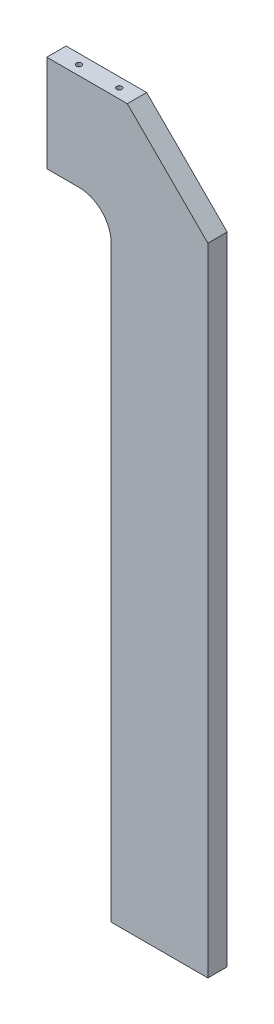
ISO-10303-21;
HEADER;
FILE_DESCRIPTION(('STEP AP214'),'2;1');
FILE_NAME('part.step','',(''),(''),'','','');
FILE_SCHEMA(('AUTOMOTIVE_DESIGN { 1 0 10303 214 1 1 1 1 }'));
ENDSEC;
DATA;
#1=APPLICATION_CONTEXT('core data for automotive mechanical design processes');
#2=APPLICATION_PROTOCOL_DEFINITION('international standard','automotive_design',2000,#1);
#3=PRODUCT_CONTEXT('',#1,'mechanical');
#4=PRODUCT('Part','Part','',(#3));
#5=PRODUCT_RELATED_PRODUCT_CATEGORY('part','',(#4));
#6=PRODUCT_DEFINITION_FORMATION('','',#4);
#7=PRODUCT_DEFINITION_CONTEXT('part definition',#1,'design');
#8=PRODUCT_DEFINITION('design','',#6,#7);
#9=PRODUCT_DEFINITION_SHAPE('','',#8);
#10=(LENGTH_UNIT() NAMED_UNIT(*) SI_UNIT(.MILLI.,.METRE.));
#11=(NAMED_UNIT(*) PLANE_ANGLE_UNIT() SI_UNIT($,.RADIAN.));
#12=(NAMED_UNIT(*) SI_UNIT($,.STERADIAN.) SOLID_ANGLE_UNIT());
#13=UNCERTAINTY_MEASURE_WITH_UNIT(LENGTH_MEASURE(1.E-05),#10,'distance_accuracy_value','');
#14=(GEOMETRIC_REPRESENTATION_CONTEXT(3) GLOBAL_UNCERTAINTY_ASSIGNED_CONTEXT((#13)) GLOBAL_UNIT_ASSIGNED_CONTEXT((#10,
#11,#12)) REPRESENTATION_CONTEXT('',''));
#15=CARTESIAN_POINT('',(0.,0.,0.));
#16=DIRECTION('',(0.,0.,1.));
#17=DIRECTION('',(1.,0.,0.));
#18=AXIS2_PLACEMENT_3D('',#15,#16,#17);
#19=CARTESIAN_POINT('',(-9.80148028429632,-337.147129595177,12.));
#20=DIRECTION('',(-1.,0.,0.));
#21=DIRECTION('',(0.,0.,1.));
#22=AXIS2_PLACEMENT_3D('',#19,#20,#21);
#23=PLANE('',#22);
#24=DIRECTION('',(0.,1.,0.));
#25=VECTOR('',#24,1.);
#26=CARTESIAN_POINT('',(-9.80148028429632,-337.147129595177,0.));
#27=LINE('',#26,#25);
#28=CARTESIAN_POINT('',(-9.80148028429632,-337.147129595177,0.));
#29=VERTEX_POINT('',#28);
#30=CARTESIAN_POINT('',(-9.80148028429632,57.8528704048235,0.));
#31=VERTEX_POINT('',#30);
#32=EDGE_CURVE('E250',#29,#31,#27,.T.);
#33=ORIENTED_EDGE('',*,*,#32,.T.);
#34=DIRECTION('',(0.,0.,1.));
#35=VECTOR('',#34,1.);
#36=CARTESIAN_POINT('',(-9.80148028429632,57.8528704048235,12.));
#37=LINE('',#36,#35);
#38=CARTESIAN_POINT('',(-9.80148028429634,57.8528704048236,12.));
#39=VERTEX_POINT('',#38);
#40=EDGE_CURVE('E253',#31,#39,#37,.T.);
#41=ORIENTED_EDGE('',*,*,#40,.T.);
#42=DIRECTION('',(0.,1.,0.));
#43=VECTOR('',#42,1.);
#44=CARTESIAN_POINT('',(-9.80148028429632,-337.147129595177,12.));
#45=LINE('',#44,#43);
#46=CARTESIAN_POINT('',(-9.80148028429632,-337.147129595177,12.));
#47=VERTEX_POINT('',#46);
#48=EDGE_CURVE('E289',#47,#39,#45,.T.);
#49=ORIENTED_EDGE('',*,*,#48,.F.);
#50=DIRECTION('',(0.,0.,-1.));
#51=VECTOR('',#50,1.);
#52=CARTESIAN_POINT('',(-9.80148028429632,-337.147129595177,12.));
#53=LINE('',#52,#51);
#54=EDGE_CURVE('E256',#47,#29,#53,.T.);
#55=ORIENTED_EDGE('',*,*,#54,.T.);
#56=EDGE_LOOP('',(#33,#41,#49,#55));
#57=FACE_BOUND('',#56,.T.);
#58=ADVANCED_FACE('F16',(#57),#23,.F.);
#59=CARTESIAN_POINT('',(-9.80148028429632,107.852870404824,12.));
#60=DIRECTION('',(0.,-1.,0.));
#61=DIRECTION('',(0.,0.,-1.));
#62=AXIS2_PLACEMENT_3D('',#59,#60,#61);
#63=PLANE('',#62);
#64=CARTESIAN_POINT('',(-95.8014802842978,107.852870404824,5.99999999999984));
#65=DIRECTION('',(0.,1.,0.));
#66=DIRECTION('',(0.,0.,1.));
#67=AXIS2_PLACEMENT_3D('',#64,#65,#66);
#68=CIRCLE('',#67,1.65);
#69=CARTESIAN_POINT('',(-95.8014802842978,107.852870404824,7.64999999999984));
#70=VERTEX_POINT('',#69);
#71=EDGE_CURVE('E130',#70,#70,#68,.T.);
#72=ORIENTED_EDGE('',*,*,#71,.F.);
#73=EDGE_LOOP('',(#72));
#74=FACE_BOUND('',#73,.T.);
#75=CARTESIAN_POINT('',(-70.8014802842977,107.852870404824,5.99999999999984));
#76=DIRECTION('',(0.,1.,0.));
#77=DIRECTION('',(0.,0.,1.));
#78=AXIS2_PLACEMENT_3D('',#75,#76,#77);
#79=CIRCLE('',#78,1.65);
#80=CARTESIAN_POINT('',(-70.8014802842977,107.852870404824,7.64999999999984));
#81=VERTEX_POINT('',#80);
#82=EDGE_CURVE('E349',#81,#81,#79,.T.);
#83=ORIENTED_EDGE('',*,*,#82,.F.);
#84=EDGE_LOOP('',(#83));
#85=FACE_BOUND('',#84,.T.);
#86=DIRECTION('',(-1.,0.,0.));
#87=VECTOR('',#86,1.);
#88=CARTESIAN_POINT('',(-9.80148028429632,107.852870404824,12.));
#89=LINE('',#88,#87);
#90=CARTESIAN_POINT('',(-59.8014802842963,107.852870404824,12.));
#91=VERTEX_POINT('',#90);
#92=CARTESIAN_POINT('',(-109.801480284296,107.852870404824,12.));
#93=VERTEX_POINT('',#92);
#94=EDGE_CURVE('E308',#91,#93,#89,.T.);
#95=ORIENTED_EDGE('',*,*,#94,.F.);
#96=DIRECTION('',(0.,0.,-1.));
#97=VECTOR('',#96,1.);
#98=CARTESIAN_POINT('',(-59.8014802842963,107.852870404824,12.));
#99=LINE('',#98,#97);
#100=CARTESIAN_POINT('',(-59.8014802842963,107.852870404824,0.));
#101=VERTEX_POINT('',#100);
#102=EDGE_CURVE('E266',#91,#101,#99,.T.);
#103=ORIENTED_EDGE('',*,*,#102,.T.);
#104=DIRECTION('',(-1.,0.,0.));
#105=VECTOR('',#104,1.);
#106=CARTESIAN_POINT('',(-9.80148028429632,107.852870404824,0.));
#107=LINE('',#106,#105);
#108=CARTESIAN_POINT('',(-109.801480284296,107.852870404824,0.));
#109=VERTEX_POINT('',#108);
#110=EDGE_CURVE('E258',#101,#109,#107,.T.);
#111=ORIENTED_EDGE('',*,*,#110,.T.);
#112=DIRECTION('',(0.,0.,-1.));
#113=VECTOR('',#112,1.);
#114=CARTESIAN_POINT('',(-109.801480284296,107.852870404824,12.));
#115=LINE('',#114,#113);
#116=EDGE_CURVE('E270',#93,#109,#115,.T.);
#117=ORIENTED_EDGE('',*,*,#116,.F.);
#118=EDGE_LOOP('',(#95,#103,#111,#117));
#119=FACE_BOUND('',#118,.T.);
#120=ADVANCED_FACE('F237',(#74,#85,#119),#63,.F.);
#121=CARTESIAN_POINT('',(-109.801480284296,107.852870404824,12.));
#122=DIRECTION('',(1.,0.,0.));
#123=DIRECTION('',(0.,1.,0.));
#124=AXIS2_PLACEMENT_3D('',#121,#122,#123);
#125=PLANE('',#124);
#126=CARTESIAN_POINT('',(-109.801480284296,102.852870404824,6.));
#127=DIRECTION('',(-1.,0.,0.));
#128=DIRECTION('',(0.,0.,1.));
#129=AXIS2_PLACEMENT_3D('',#126,#127,#128);
#130=CIRCLE('',#129,2.5);
#131=CARTESIAN_POINT('',(-109.801480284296,102.852870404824,8.5));
#132=VERTEX_POINT('',#131);
#133=EDGE_CURVE('E344',#132,#132,#130,.T.);
#134=ORIENTED_EDGE('',*,*,#133,.F.);
#135=EDGE_LOOP('',(#134));
#136=FACE_BOUND('',#135,.T.);
#137=CARTESIAN_POINT('',(-109.801480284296,77.8528704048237,6.));
#138=DIRECTION('',(-1.,0.,0.));
#139=DIRECTION('',(0.,0.,1.));
#140=AXIS2_PLACEMENT_3D('',#137,#138,#139);
#141=CIRCLE('',#140,2.5);
#142=CARTESIAN_POINT('',(-109.801480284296,77.8528704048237,8.5));
#143=VERTEX_POINT('',#142);
#144=EDGE_CURVE('E337',#143,#143,#141,.T.);
#145=ORIENTED_EDGE('',*,*,#144,.F.);
#146=EDGE_LOOP('',(#145));
#147=FACE_BOUND('',#146,.T.);
#148=CARTESIAN_POINT('',(-109.801480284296,52.8528704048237,6.));
#149=DIRECTION('',(-1.,0.,0.));
#150=DIRECTION('',(0.,0.,1.));
#151=AXIS2_PLACEMENT_3D('',#148,#149,#150);
#152=CIRCLE('',#151,2.5);
#153=CARTESIAN_POINT('',(-109.801480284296,52.8528704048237,8.5));
#154=VERTEX_POINT('',#153);
#155=EDGE_CURVE('E331',#154,#154,#152,.T.);
#156=ORIENTED_EDGE('',*,*,#155,.F.);
#157=EDGE_LOOP('',(#156));
#158=FACE_BOUND('',#157,.T.);
#159=DIRECTION('',(0.,-1.,0.));
#160=VECTOR('',#159,1.);
#161=CARTESIAN_POINT('',(-109.801480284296,107.852870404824,0.));
#162=LINE('',#161,#160);
#163=CARTESIAN_POINT('',(-109.801480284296,47.8528704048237,0.));
#164=VERTEX_POINT('',#163);
#165=EDGE_CURVE('E296',#109,#164,#162,.T.);
#166=ORIENTED_EDGE('',*,*,#165,.T.);
#167=DIRECTION('',(0.,0.,-1.));
#168=VECTOR('',#167,1.);
#169=CARTESIAN_POINT('',(-109.801480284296,47.8528704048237,12.));
#170=LINE('',#169,#168);
#171=CARTESIAN_POINT('',(-109.801480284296,47.8528704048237,12.));
#172=VERTEX_POINT('',#171);
#173=EDGE_CURVE('E273',#172,#164,#170,.T.);
#174=ORIENTED_EDGE('',*,*,#173,.F.);
#175=DIRECTION('',(0.,-1.,0.));
#176=VECTOR('',#175,1.);
#177=CARTESIAN_POINT('',(-109.801480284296,107.852870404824,12.));
#178=LINE('',#177,#176);
#179=EDGE_CURVE('E306',#93,#172,#178,.T.);
#180=ORIENTED_EDGE('',*,*,#179,.F.);
#181=ORIENTED_EDGE('',*,*,#116,.T.);
#182=EDGE_LOOP('',(#166,#174,#180,#181));
#183=FACE_BOUND('',#182,.T.);
#184=ADVANCED_FACE('F233',(#136,#147,#158,#183),#125,.F.);
#185=CARTESIAN_POINT('',(-89.8014802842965,47.8528704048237,12.));
#186=DIRECTION('',(0.,1.,0.));
#187=DIRECTION('',(-1.,0.,0.));
#188=AXIS2_PLACEMENT_3D('',#185,#186,#187);
#189=PLANE('',#188);
#190=DIRECTION('',(1.,0.,0.));
#191=VECTOR('',#190,1.);
#192=CARTESIAN_POINT('',(-89.8014802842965,47.8528704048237,0.));
#193=LINE('',#192,#191);
#194=CARTESIAN_POINT('',(-89.8014802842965,47.8528704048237,0.));
#195=VERTEX_POINT('',#194);
#196=EDGE_CURVE('E294',#164,#195,#193,.T.);
#197=ORIENTED_EDGE('',*,*,#196,.T.);
#198=DIRECTION('',(0.,0.,-1.));
#199=VECTOR('',#198,1.);
#200=CARTESIAN_POINT('',(-89.8014802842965,47.8528704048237,12.));
#201=LINE('',#200,#199);
#202=CARTESIAN_POINT('',(-89.8014802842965,47.8528704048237,12.));
#203=VERTEX_POINT('',#202);
#204=EDGE_CURVE('E276',#203,#195,#201,.T.);
#205=ORIENTED_EDGE('',*,*,#204,.F.);
#206=DIRECTION('',(1.,0.,0.));
#207=VECTOR('',#206,1.);
#208=CARTESIAN_POINT('',(-89.8014802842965,47.8528704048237,12.));
#209=LINE('',#208,#207);
#210=EDGE_CURVE('E304',#172,#203,#209,.T.);
#211=ORIENTED_EDGE('',*,*,#210,.F.);
#212=ORIENTED_EDGE('',*,*,#173,.T.);
#213=EDGE_LOOP('',(#197,#205,#211,#212));
#214=FACE_BOUND('',#213,.T.);
#215=ADVANCED_FACE('F229',(#214),#189,.F.);
#216=CARTESIAN_POINT('',(-89.8014802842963,27.8528704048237,12.));
#217=DIRECTION('',(0.,0.,-1.));
#218=DIRECTION('',(-1.,0.,0.));
#219=AXIS2_PLACEMENT_3D('',#216,#217,#218);
#220=CYLINDRICAL_SURFACE('',#219,20.);
#221=CARTESIAN_POINT('',(-89.8014802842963,27.8528704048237,0.));
#222=DIRECTION('',(0.,0.,-1.));
#223=DIRECTION('',(1.,0.,0.));
#224=AXIS2_PLACEMENT_3D('',#221,#222,#223);
#225=CIRCLE('',#224,20.);
#226=CARTESIAN_POINT('',(-69.8014802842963,27.8528704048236,0.));
#227=VERTEX_POINT('',#226);
#228=EDGE_CURVE('E292',#195,#227,#225,.T.);
#229=ORIENTED_EDGE('',*,*,#228,.T.);
#230=DIRECTION('',(0.,0.,-1.));
#231=VECTOR('',#230,1.);
#232=CARTESIAN_POINT('',(-69.8014802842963,27.8528704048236,12.));
#233=LINE('',#232,#231);
#234=CARTESIAN_POINT('',(-69.8014802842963,27.8528704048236,12.));
#235=VERTEX_POINT('',#234);
#236=EDGE_CURVE('E279',#235,#227,#233,.T.);
#237=ORIENTED_EDGE('',*,*,#236,.F.);
#238=CARTESIAN_POINT('',(-89.8014802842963,27.8528704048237,12.));
#239=DIRECTION('',(0.,0.,-1.));
#240=DIRECTION('',(1.,0.,0.));
#241=AXIS2_PLACEMENT_3D('',#238,#239,#240);
#242=CIRCLE('',#241,20.);
#243=EDGE_CURVE('E302',#203,#235,#242,.T.);
#244=ORIENTED_EDGE('',*,*,#243,.F.);
#245=ORIENTED_EDGE('',*,*,#204,.T.);
#246=EDGE_LOOP('',(#229,#237,#244,#245));
#247=FACE_BOUND('',#246,.T.);
#248=ADVANCED_FACE('F225',(#247),#220,.F.);
#249=CARTESIAN_POINT('',(-69.8014802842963,-337.147129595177,12.));
#250=DIRECTION('',(1.,0.,0.));
#251=DIRECTION('',(0.,0.,-1.));
#252=AXIS2_PLACEMENT_3D('',#249,#250,#251);
#253=PLANE('',#252);
#254=DIRECTION('',(0.,-1.,0.));
#255=VECTOR('',#254,1.);
#256=CARTESIAN_POINT('',(-69.8014802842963,-337.147129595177,0.));
#257=LINE('',#256,#255);
#258=CARTESIAN_POINT('',(-69.8014802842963,-337.147129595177,0.));
#259=VERTEX_POINT('',#258);
#260=EDGE_CURVE('E290',#227,#259,#257,.T.);
#261=ORIENTED_EDGE('',*,*,#260,.T.);
#262=DIRECTION('',(0.,0.,-1.));
#263=VECTOR('',#262,1.);
#264=CARTESIAN_POINT('',(-69.8014802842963,-337.147129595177,12.));
#265=LINE('',#264,#263);
#266=CARTESIAN_POINT('',(-69.8014802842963,-337.147129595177,12.));
#267=VERTEX_POINT('',#266);
#268=EDGE_CURVE('E282',#267,#259,#265,.T.);
#269=ORIENTED_EDGE('',*,*,#268,.F.);
#270=DIRECTION('',(0.,-1.,0.));
#271=VECTOR('',#270,1.);
#272=CARTESIAN_POINT('',(-69.8014802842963,-337.147129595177,12.));
#273=LINE('',#272,#271);
#274=EDGE_CURVE('E300',#235,#267,#273,.T.);
#275=ORIENTED_EDGE('',*,*,#274,.F.);
#276=ORIENTED_EDGE('',*,*,#236,.T.);
#277=EDGE_LOOP('',(#261,#269,#275,#276));
#278=FACE_BOUND('',#277,.T.);
#279=ADVANCED_FACE('F221',(#278),#253,.F.);
#280=CARTESIAN_POINT('',(-9.80148028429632,-337.147129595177,12.));
#281=DIRECTION('',(0.,1.,0.));
#282=DIRECTION('',(0.,0.,1.));
#283=AXIS2_PLACEMENT_3D('',#280,#281,#282);
#284=PLANE('',#283);
#285=CARTESIAN_POINT('',(-57.8014802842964,-337.147129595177,6.));
#286=DIRECTION('',(0.,-1.,0.));
#287=DIRECTION('',(0.,0.,-1.));
#288=AXIS2_PLACEMENT_3D('',#285,#286,#287);
#289=CIRCLE('',#288,2.5);
#290=CARTESIAN_POINT('',(-57.8014802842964,-337.147129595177,3.5));
#291=VERTEX_POINT('',#290);
#292=EDGE_CURVE('E325',#291,#291,#289,.T.);
#293=ORIENTED_EDGE('',*,*,#292,.F.);
#294=EDGE_LOOP('',(#293));
#295=FACE_BOUND('',#294,.T.);
#296=CARTESIAN_POINT('',(-39.8014802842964,-337.147129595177,6.));
#297=DIRECTION('',(0.,-1.,0.));
#298=DIRECTION('',(0.,0.,-1.));
#299=AXIS2_PLACEMENT_3D('',#296,#297,#298);
#300=CIRCLE('',#299,2.5);
#301=CARTESIAN_POINT('',(-39.8014802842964,-337.147129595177,3.5));
#302=VERTEX_POINT('',#301);
#303=EDGE_CURVE('E319',#302,#302,#300,.T.);
#304=ORIENTED_EDGE('',*,*,#303,.F.);
#305=EDGE_LOOP('',(#304));
#306=FACE_BOUND('',#305,.T.);
#307=CARTESIAN_POINT('',(-21.8014802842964,-337.147129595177,6.));
#308=DIRECTION('',(0.,-1.,0.));
#309=DIRECTION('',(0.,0.,-1.));
#310=AXIS2_PLACEMENT_3D('',#307,#308,#309);
#311=CIRCLE('',#310,2.5);
#312=CARTESIAN_POINT('',(-21.8014802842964,-337.147129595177,3.5));
#313=VERTEX_POINT('',#312);
#314=EDGE_CURVE('E313',#313,#313,#311,.T.);
#315=ORIENTED_EDGE('',*,*,#314,.F.);
#316=EDGE_LOOP('',(#315));
#317=FACE_BOUND('',#316,.T.);
#318=DIRECTION('',(1.,0.,0.));
#319=VECTOR('',#318,1.);
#320=CARTESIAN_POINT('',(-9.80148028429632,-337.147129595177,0.));
#321=LINE('',#320,#319);
#322=EDGE_CURVE('E287',#259,#29,#321,.T.);
#323=ORIENTED_EDGE('',*,*,#322,.T.);
#324=ORIENTED_EDGE('',*,*,#54,.F.);
#325=DIRECTION('',(1.,0.,0.));
#326=VECTOR('',#325,1.);
#327=CARTESIAN_POINT('',(-9.80148028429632,-337.147129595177,12.));
#328=LINE('',#327,#326);
#329=EDGE_CURVE('E286',#267,#47,#328,.T.);
#330=ORIENTED_EDGE('',*,*,#329,.F.);
#331=ORIENTED_EDGE('',*,*,#268,.T.);
#332=EDGE_LOOP('',(#323,#324,#330,#331));
#333=FACE_BOUND('',#332,.T.);
#334=ADVANCED_FACE('F214',(#295,#306,#317,#333),#284,.F.);
#335=CARTESIAN_POINT('',(-89.8014802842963,27.8528704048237,12.));
#336=DIRECTION('',(0.,0.,1.));
#337=DIRECTION('',(1.,0.,0.));
#338=AXIS2_PLACEMENT_3D('',#335,#336,#337);
#339=PLANE('',#338);
#340=ORIENTED_EDGE('',*,*,#48,.T.);
#341=DIRECTION('',(0.707106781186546,-0.707106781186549,0.));
#342=VECTOR('',#341,1.);
#343=CARTESIAN_POINT('',(-34.8014802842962,82.8528704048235,12.));
#344=LINE('',#343,#342);
#345=EDGE_CURVE('E162',#39,#91,#344,.F.);
#346=ORIENTED_EDGE('',*,*,#345,.T.);
#347=ORIENTED_EDGE('',*,*,#94,.T.);
#348=ORIENTED_EDGE('',*,*,#179,.T.);
#349=ORIENTED_EDGE('',*,*,#210,.T.);
#350=ORIENTED_EDGE('',*,*,#243,.T.);
#351=ORIENTED_EDGE('',*,*,#274,.T.);
#352=ORIENTED_EDGE('',*,*,#329,.T.);
#353=EDGE_LOOP('',(#340,#346,#347,#348,#349,#350,#351,#352));
#354=FACE_BOUND('',#353,.T.);
#355=ADVANCED_FACE('F210',(#354),#339,.T.);
#356=CARTESIAN_POINT('',(-89.8014802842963,27.8528704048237,0.));
#357=DIRECTION('',(0.,0.,1.));
#358=DIRECTION('',(1.,0.,0.));
#359=AXIS2_PLACEMENT_3D('',#356,#357,#358);
#360=PLANE('',#359);
#361=ORIENTED_EDGE('',*,*,#110,.F.);
#362=DIRECTION('',(-0.707106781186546,0.707106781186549,0.));
#363=VECTOR('',#362,1.);
#364=CARTESIAN_POINT('',(-59.8014802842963,107.852870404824,0.));
#365=LINE('',#364,#363);
#366=EDGE_CURVE('E264',#101,#31,#365,.F.);
#367=ORIENTED_EDGE('',*,*,#366,.T.);
#368=ORIENTED_EDGE('',*,*,#32,.F.);
#369=ORIENTED_EDGE('',*,*,#322,.F.);
#370=ORIENTED_EDGE('',*,*,#260,.F.);
#371=ORIENTED_EDGE('',*,*,#228,.F.);
#372=ORIENTED_EDGE('',*,*,#196,.F.);
#373=ORIENTED_EDGE('',*,*,#165,.F.);
#374=EDGE_LOOP('',(#361,#367,#368,#369,#370,#371,#372,#373));
#375=FACE_BOUND('',#374,.T.);
#376=ADVANCED_FACE('F213',(#375),#360,.F.);
#377=CARTESIAN_POINT('',(-59.8014802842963,107.852870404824,12.));
#378=DIRECTION('',(-0.707106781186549,-0.707106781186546,0.));
#379=DIRECTION('',(0.,0.,-1.));
#380=AXIS2_PLACEMENT_3D('',#377,#378,#379);
#381=PLANE('',#380);
#382=ORIENTED_EDGE('',*,*,#345,.F.);
#383=ORIENTED_EDGE('',*,*,#40,.F.);
#384=ORIENTED_EDGE('',*,*,#366,.F.);
#385=ORIENTED_EDGE('',*,*,#102,.F.);
#386=EDGE_LOOP('',(#382,#383,#384,#385));
#387=FACE_BOUND('',#386,.T.);
#388=ADVANCED_FACE('F18',(#387),#381,.F.);
#389=CARTESIAN_POINT('',(-21.8014802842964,-322.147129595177,6.));
#390=DIRECTION('',(0.,-1.,0.));
#391=DIRECTION('',(0.,0.,-1.));
#392=AXIS2_PLACEMENT_3D('',#389,#390,#391);
#393=CONICAL_SURFACE('',#392,2.5,1.02974425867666);
#394=CARTESIAN_POINT('',(-21.8014802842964,-320.644978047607,6.));
#395=VERTEX_POINT('',#394);
#396=VERTEX_LOOP('',#395);
#397=FACE_BOUND('',#396,.T.);
#398=CARTESIAN_POINT('',(-21.8014802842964,-322.147129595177,6.));
#399=DIRECTION('',(0.,-1.,0.));
#400=DIRECTION('',(0.,0.,-1.));
#401=AXIS2_PLACEMENT_3D('',#398,#399,#400);
#402=CIRCLE('',#401,2.5);
#403=CARTESIAN_POINT('',(-21.8014802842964,-322.147129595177,3.5));
#404=VERTEX_POINT('',#403);
#405=EDGE_CURVE('E259',#404,#404,#402,.T.);
#406=ORIENTED_EDGE('',*,*,#405,.T.);
#407=EDGE_LOOP('',(#406));
#408=FACE_BOUND('',#407,.T.);
#409=ADVANCED_FACE('F205',(#397,#408),#393,.F.);
#410=CARTESIAN_POINT('',(-21.8014802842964,-337.147129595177,6.));
#411=DIRECTION('',(0.,-1.,0.));
#412=DIRECTION('',(0.,0.,-1.));
#413=AXIS2_PLACEMENT_3D('',#410,#411,#412);
#414=CYLINDRICAL_SURFACE('',#413,2.5);
#415=ORIENTED_EDGE('',*,*,#405,.F.);
#416=EDGE_LOOP('',(#415));
#417=FACE_BOUND('',#416,.T.);
#418=ORIENTED_EDGE('',*,*,#314,.T.);
#419=EDGE_LOOP('',(#418));
#420=FACE_BOUND('',#419,.T.);
#421=ADVANCED_FACE('F201',(#417,#420),#414,.F.);
#422=CARTESIAN_POINT('',(-39.8014802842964,-322.147129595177,6.));
#423=DIRECTION('',(0.,-1.,0.));
#424=DIRECTION('',(0.,0.,-1.));
#425=AXIS2_PLACEMENT_3D('',#422,#423,#424);
#426=CONICAL_SURFACE('',#425,2.5,1.02974425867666);
#427=CARTESIAN_POINT('',(-39.8014802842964,-320.644978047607,6.));
#428=VERTEX_POINT('',#427);
#429=VERTEX_LOOP('',#428);
#430=FACE_BOUND('',#429,.T.);
#431=CARTESIAN_POINT('',(-39.8014802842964,-322.147129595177,6.));
#432=DIRECTION('',(0.,-1.,0.));
#433=DIRECTION('',(0.,0.,-1.));
#434=AXIS2_PLACEMENT_3D('',#431,#432,#433);
#435=CIRCLE('',#434,2.5);
#436=CARTESIAN_POINT('',(-39.8014802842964,-322.147129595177,3.5));
#437=VERTEX_POINT('',#436);
#438=EDGE_CURVE('E316',#437,#437,#435,.T.);
#439=ORIENTED_EDGE('',*,*,#438,.T.);
#440=EDGE_LOOP('',(#439));
#441=FACE_BOUND('',#440,.T.);
#442=ADVANCED_FACE('F197',(#430,#441),#426,.F.);
#443=CARTESIAN_POINT('',(-39.8014802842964,-337.147129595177,6.));
#444=DIRECTION('',(0.,-1.,0.));
#445=DIRECTION('',(0.,0.,-1.));
#446=AXIS2_PLACEMENT_3D('',#443,#444,#445);
#447=CYLINDRICAL_SURFACE('',#446,2.5);
#448=ORIENTED_EDGE('',*,*,#438,.F.);
#449=EDGE_LOOP('',(#448));
#450=FACE_BOUND('',#449,.T.);
#451=ORIENTED_EDGE('',*,*,#303,.T.);
#452=EDGE_LOOP('',(#451));
#453=FACE_BOUND('',#452,.T.);
#454=ADVANCED_FACE('F193',(#450,#453),#447,.F.);
#455=CARTESIAN_POINT('',(-57.8014802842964,-322.147129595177,6.));
#456=DIRECTION('',(0.,-1.,0.));
#457=DIRECTION('',(0.,0.,-1.));
#458=AXIS2_PLACEMENT_3D('',#455,#456,#457);
#459=CONICAL_SURFACE('',#458,2.5,1.02974425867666);
#460=CARTESIAN_POINT('',(-57.8014802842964,-320.644978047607,6.));
#461=VERTEX_POINT('',#460);
#462=VERTEX_LOOP('',#461);
#463=FACE_BOUND('',#462,.T.);
#464=CARTESIAN_POINT('',(-57.8014802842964,-322.147129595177,6.));
#465=DIRECTION('',(0.,-1.,0.));
#466=DIRECTION('',(0.,0.,-1.));
#467=AXIS2_PLACEMENT_3D('',#464,#465,#466);
#468=CIRCLE('',#467,2.5);
#469=CARTESIAN_POINT('',(-57.8014802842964,-322.147129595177,3.5));
#470=VERTEX_POINT('',#469);
#471=EDGE_CURVE('E322',#470,#470,#468,.T.);
#472=ORIENTED_EDGE('',*,*,#471,.T.);
#473=EDGE_LOOP('',(#472));
#474=FACE_BOUND('',#473,.T.);
#475=ADVANCED_FACE('F189',(#463,#474),#459,.F.);
#476=CARTESIAN_POINT('',(-57.8014802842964,-337.147129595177,6.));
#477=DIRECTION('',(0.,-1.,0.));
#478=DIRECTION('',(0.,0.,-1.));
#479=AXIS2_PLACEMENT_3D('',#476,#477,#478);
#480=CYLINDRICAL_SURFACE('',#479,2.5);
#481=ORIENTED_EDGE('',*,*,#471,.F.);
#482=EDGE_LOOP('',(#481));
#483=FACE_BOUND('',#482,.T.);
#484=ORIENTED_EDGE('',*,*,#292,.T.);
#485=EDGE_LOOP('',(#484));
#486=FACE_BOUND('',#485,.T.);
#487=ADVANCED_FACE('F185',(#483,#486),#480,.F.);
#488=CARTESIAN_POINT('',(-94.8014802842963,52.8528704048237,6.));
#489=DIRECTION('',(-1.,0.,0.));
#490=DIRECTION('',(0.,0.,1.));
#491=AXIS2_PLACEMENT_3D('',#488,#489,#490);
#492=CONICAL_SURFACE('',#491,2.5,1.02974425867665);
#493=CARTESIAN_POINT('',(-93.2993287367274,52.8528704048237,6.));
#494=VERTEX_POINT('',#493);
#495=VERTEX_LOOP('',#494);
#496=FACE_BOUND('',#495,.T.);
#497=CARTESIAN_POINT('',(-94.8014802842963,52.8528704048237,6.));
#498=DIRECTION('',(-1.,0.,0.));
#499=DIRECTION('',(0.,0.,1.));
#500=AXIS2_PLACEMENT_3D('',#497,#498,#499);
#501=CIRCLE('',#500,2.5);
#502=CARTESIAN_POINT('',(-94.8014802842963,52.8528704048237,8.5));
#503=VERTEX_POINT('',#502);
#504=EDGE_CURVE('E328',#503,#503,#501,.T.);
#505=ORIENTED_EDGE('',*,*,#504,.T.);
#506=EDGE_LOOP('',(#505));
#507=FACE_BOUND('',#506,.T.);
#508=ADVANCED_FACE('F181',(#496,#507),#492,.F.);
#509=CARTESIAN_POINT('',(-109.801480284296,52.8528704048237,6.));
#510=DIRECTION('',(-1.,0.,0.));
#511=DIRECTION('',(0.,0.,1.));
#512=AXIS2_PLACEMENT_3D('',#509,#510,#511);
#513=CYLINDRICAL_SURFACE('',#512,2.5);
#514=ORIENTED_EDGE('',*,*,#504,.F.);
#515=EDGE_LOOP('',(#514));
#516=FACE_BOUND('',#515,.T.);
#517=ORIENTED_EDGE('',*,*,#155,.T.);
#518=EDGE_LOOP('',(#517));
#519=FACE_BOUND('',#518,.T.);
#520=ADVANCED_FACE('F177',(#516,#519),#513,.F.);
#521=CARTESIAN_POINT('',(-94.8014802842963,77.8528704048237,6.));
#522=DIRECTION('',(-1.,0.,0.));
#523=DIRECTION('',(0.,0.,1.));
#524=AXIS2_PLACEMENT_3D('',#521,#522,#523);
#525=CONICAL_SURFACE('',#524,2.5,1.02974425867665);
#526=CARTESIAN_POINT('',(-93.2993287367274,77.8528704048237,6.));
#527=VERTEX_POINT('',#526);
#528=VERTEX_LOOP('',#527);
#529=FACE_BOUND('',#528,.T.);
#530=CARTESIAN_POINT('',(-94.8014802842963,77.8528704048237,6.));
#531=DIRECTION('',(-1.,0.,0.));
#532=DIRECTION('',(0.,0.,1.));
#533=AXIS2_PLACEMENT_3D('',#530,#531,#532);
#534=CIRCLE('',#533,2.5);
#535=CARTESIAN_POINT('',(-94.8014802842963,77.8528704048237,8.5));
#536=VERTEX_POINT('',#535);
#537=EDGE_CURVE('E334',#536,#536,#534,.T.);
#538=ORIENTED_EDGE('',*,*,#537,.T.);
#539=EDGE_LOOP('',(#538));
#540=FACE_BOUND('',#539,.T.);
#541=ADVANCED_FACE('F173',(#529,#540),#525,.F.);
#542=CARTESIAN_POINT('',(-109.801480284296,77.8528704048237,6.));
#543=DIRECTION('',(-1.,0.,0.));
#544=DIRECTION('',(0.,0.,1.));
#545=AXIS2_PLACEMENT_3D('',#542,#543,#544);
#546=CYLINDRICAL_SURFACE('',#545,2.5);
#547=ORIENTED_EDGE('',*,*,#537,.F.);
#548=EDGE_LOOP('',(#547));
#549=FACE_BOUND('',#548,.T.);
#550=ORIENTED_EDGE('',*,*,#144,.T.);
#551=EDGE_LOOP('',(#550));
#552=FACE_BOUND('',#551,.T.);
#553=ADVANCED_FACE('F168',(#549,#552),#546,.F.);
#554=CARTESIAN_POINT('',(-94.8014802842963,102.852870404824,6.));
#555=DIRECTION('',(-1.,0.,0.));
#556=DIRECTION('',(0.,0.,1.));
#557=AXIS2_PLACEMENT_3D('',#554,#555,#556);
#558=CONICAL_SURFACE('',#557,2.5,1.02974425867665);
#559=CARTESIAN_POINT('',(-93.2993287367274,102.852870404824,6.));
#560=VERTEX_POINT('',#559);
#561=VERTEX_LOOP('',#560);
#562=FACE_BOUND('',#561,.T.);
#563=CARTESIAN_POINT('',(-94.8014802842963,102.852870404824,6.));
#564=DIRECTION('',(-1.,0.,0.));
#565=DIRECTION('',(0.,0.,1.));
#566=AXIS2_PLACEMENT_3D('',#563,#564,#565);
#567=CIRCLE('',#566,2.5);
#568=CARTESIAN_POINT('',(-94.8014802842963,100.725078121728,7.31244047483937));
#569=VERTEX_POINT('',#568);
#570=CARTESIAN_POINT('',(-94.801480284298,104.980662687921,7.3124404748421));
#571=VERTEX_POINT('',#570);
#572=EDGE_CURVE('E341',#569,#571,#567,.T.);
#573=ORIENTED_EDGE('',*,*,#572,.T.);
#574=CARTESIAN_POINT('',(-95.6035489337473,106.320272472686,7.63808521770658));
#575=CARTESIAN_POINT('',(-95.5744526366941,106.268378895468,7.63456703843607));
#576=CARTESIAN_POINT('',(-95.5452900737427,106.216578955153,7.63025958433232));
#577=CARTESIAN_POINT('',(-95.4868170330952,106.11321839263,7.61999061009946));
#578=CARTESIAN_POINT('',(-95.4575065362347,106.061657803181,7.61402886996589));
#579=CARTESIAN_POINT('',(-95.3690541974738,105.90693091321,7.59348384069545));
#580=CARTESIAN_POINT('',(-95.3096759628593,105.804228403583,7.57627361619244));
#581=CARTESIAN_POINT('',(-95.1868580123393,105.595136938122,7.53271876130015));
#582=CARTESIAN_POINT('',(-95.123377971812,105.488866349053,7.50591406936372));
#583=CARTESIAN_POINT('',(-94.9956183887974,105.280273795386,7.44160185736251));
#584=CARTESIAN_POINT('',(-94.9313409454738,105.177943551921,7.40411834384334));
#585=CARTESIAN_POINT('',(-94.8360145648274,105.032084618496,7.3385610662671));
#586=CARTESIAN_POINT('',(-94.8052626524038,104.985926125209,7.31590087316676));
#587=CARTESIAN_POINT('',(-94.743663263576,104.89568081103,7.26691573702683));
#588=CARTESIAN_POINT('',(-94.7128158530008,104.851592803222,7.24059292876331));
#589=CARTESIAN_POINT('',(-94.6515363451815,104.76668607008,7.18399627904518));
#590=CARTESIAN_POINT('',(-94.621103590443,104.725835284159,7.1537719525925));
#591=CARTESIAN_POINT('',(-94.5606777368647,104.647855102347,7.08852398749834));
#592=CARTESIAN_POINT('',(-94.5306841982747,104.610721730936,7.05350557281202));
#593=CARTESIAN_POINT('',(-94.4669794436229,104.535733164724,6.97195393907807));
#594=CARTESIAN_POINT('',(-94.4334488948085,104.498727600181,6.92447448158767));
#595=CARTESIAN_POINT('',(-94.3695697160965,104.43328607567,6.82204350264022));
#596=CARTESIAN_POINT('',(-94.3392179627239,104.404841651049,6.76709944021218));
#597=CARTESIAN_POINT('',(-94.2838573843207,104.357237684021,6.65074542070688));
#598=CARTESIAN_POINT('',(-94.2588572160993,104.338093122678,6.58932522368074));
#599=CARTESIAN_POINT('',(-94.2160721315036,104.307964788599,6.4620646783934));
#600=CARTESIAN_POINT('',(-94.1983010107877,104.296996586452,6.3962161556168));
#601=CARTESIAN_POINT('',(-94.1710437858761,104.281130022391,6.26236492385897));
#602=CARTESIAN_POINT('',(-94.1615348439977,104.276214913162,6.19436869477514));
#603=CARTESIAN_POINT('',(-94.151052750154,104.270841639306,6.05751560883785));
#604=CARTESIAN_POINT('',(-94.1500871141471,104.270387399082,5.98865804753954));
#605=CARTESIAN_POINT('',(-94.1573592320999,104.274047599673,5.83888796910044));
#606=CARTESIAN_POINT('',(-94.1673090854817,104.279011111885,5.75806924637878));
#607=CARTESIAN_POINT('',(-94.1987408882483,104.297205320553,5.59973926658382));
#608=CARTESIAN_POINT('',(-94.2201986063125,104.310418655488,5.52222142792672));
#609=CARTESIAN_POINT('',(-94.2715047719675,104.347595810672,5.37773376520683));
#610=CARTESIAN_POINT('',(-94.3008211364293,104.370921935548,5.31041724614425));
#611=CARTESIAN_POINT('',(-94.3654673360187,104.429220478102,5.18427314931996));
#612=CARTESIAN_POINT('',(-94.4007980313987,104.464194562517,5.12544678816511));
#613=CARTESIAN_POINT('',(-94.4788226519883,104.548713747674,5.01082385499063));
#614=CARTESIAN_POINT('',(-94.5218924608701,104.599497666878,4.95622123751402));
#615=CARTESIAN_POINT('',(-94.6092029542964,104.709530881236,4.85748446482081));
#616=CARTESIAN_POINT('',(-94.6534463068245,104.768801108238,4.81337693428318));
#617=CARTESIAN_POINT('',(-94.7259362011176,104.870300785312,4.74814533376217));
#618=CARTESIAN_POINT('',(-94.754187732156,104.910951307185,4.72447460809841));
#619=CARTESIAN_POINT('',(-94.8105436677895,104.993859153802,4.68021772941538));
#620=CARTESIAN_POINT('',(-94.8386482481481,105.036113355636,4.65962593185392));
#621=CARTESIAN_POINT('',(-94.9236141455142,105.166122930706,4.60119910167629));
#622=CARTESIAN_POINT('',(-94.980248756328,105.255874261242,4.56747528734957));
#623=CARTESIAN_POINT('',(-95.0928653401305,105.438589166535,4.50855998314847));
#624=CARTESIAN_POINT('',(-95.1488463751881,105.531556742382,4.48337957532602));
#625=CARTESIAN_POINT('',(-95.2603682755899,105.719800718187,4.44010117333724));
#626=CARTESIAN_POINT('',(-95.3159070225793,105.815083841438,4.42202732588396));
#627=CARTESIAN_POINT('',(-95.4264363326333,106.006942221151,4.39217010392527));
#628=CARTESIAN_POINT('',(-95.481426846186,106.103517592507,4.38038729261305));
#629=CARTESIAN_POINT('',(-95.5588148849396,106.240612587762,4.36778108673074));
#630=CARTESIAN_POINT('',(-95.5814237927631,106.28080905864,4.36458205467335));
#631=CARTESIAN_POINT('',(-95.6264774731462,106.361168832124,4.35915053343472));
#632=CARTESIAN_POINT('',(-95.6489225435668,106.401331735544,4.35691461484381));
#633=CARTESIAN_POINT('',(-95.6713284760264,106.441538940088,4.35514118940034));
#634=B_SPLINE_CURVE_WITH_KNOTS('',3,(#574,#575,#576,#577,#578,#579,#580,#581,#582,#583,#584,
#585,#586,#587,#588,#589,#590,#591,#592,#593,#594,#595,#596,#597,#598,#599,#600,#601,#602,#603,
#604,#605,#606,#607,#608,#609,#610,#611,#612,#613,#614,#615,#616,#617,#618,#619,#620,#621,#622,
#623,#624,#625,#626,#627,#628,#629,#630,#631,#632,#633),.UNSPECIFIED.,.F.,.F.,(4,2,2,2,2,2,2,2,
2,2,2,2,2,2,2,2,2,2,2,2,2,2,2,2,2,2,2,2,2,4),(0.,0.178782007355,0.357587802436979,
0.716948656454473,1.09655878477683,1.47532217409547,1.65495305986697,1.83447968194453,
2.01191824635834,2.18916497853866,2.39500059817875,2.60063202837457,2.80659361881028,
3.0129464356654,3.21872703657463,3.42468865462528,3.66824514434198,3.91129079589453,
4.14084058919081,4.37042324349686,4.62733121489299,4.88488414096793,5.04939555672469,
5.21360157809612,5.54710866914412,5.88104672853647,6.21610983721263,6.55120293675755,
6.68988325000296,6.82806559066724),.UNSPECIFIED.);
#635=CARTESIAN_POINT('',(-94.8014802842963,104.98066268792,4.68755952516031));
#636=VERTEX_POINT('',#635);
#637=EDGE_CURVE('E11',#571,#636,#634,.T.);
#638=ORIENTED_EDGE('',*,*,#637,.T.);
#639=CARTESIAN_POINT('',(-94.801480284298,100.725078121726,4.68755952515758));
#640=VERTEX_POINT('',#639);
#641=EDGE_CURVE('E340',#636,#640,#567,.T.);
#642=ORIENTED_EDGE('',*,*,#641,.T.);
#643=CARTESIAN_POINT('',(-95.6035489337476,99.3854683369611,4.36191478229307));
#644=CARTESIAN_POINT('',(-95.5744526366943,99.4373619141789,4.36543296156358));
#645=CARTESIAN_POINT('',(-95.5452900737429,99.489161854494,4.36974041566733));
#646=CARTESIAN_POINT('',(-95.4868170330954,99.5925224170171,4.38000938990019));
#647=CARTESIAN_POINT('',(-95.4575065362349,99.6440830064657,4.38597113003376));
#648=CARTESIAN_POINT('',(-95.369054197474,99.7988098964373,4.40651615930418));
#649=CARTESIAN_POINT('',(-95.3096759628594,99.9015124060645,4.42372638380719));
#650=CARTESIAN_POINT('',(-95.1868580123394,100.110603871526,4.46728123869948));
#651=CARTESIAN_POINT('',(-95.1233779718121,100.216874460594,4.49408593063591));
#652=CARTESIAN_POINT('',(-94.9956183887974,100.425467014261,4.55839814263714));
#653=CARTESIAN_POINT('',(-94.9313409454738,100.527797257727,4.59588165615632));
#654=CARTESIAN_POINT('',(-94.8360145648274,100.673656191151,4.66143893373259));
#655=CARTESIAN_POINT('',(-94.8052626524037,100.719814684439,4.68409912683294));
#656=CARTESIAN_POINT('',(-94.743663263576,100.810059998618,4.73308426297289));
#657=CARTESIAN_POINT('',(-94.7128158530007,100.854148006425,4.7594070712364));
#658=CARTESIAN_POINT('',(-94.6515363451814,100.939054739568,4.81600372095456));
#659=CARTESIAN_POINT('',(-94.621103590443,100.979905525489,4.84622804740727));
#660=CARTESIAN_POINT('',(-94.5606777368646,101.057885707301,4.9114760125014));
#661=CARTESIAN_POINT('',(-94.5306841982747,101.095019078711,4.94649442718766));
#662=CARTESIAN_POINT('',(-94.466979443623,101.170007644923,5.02804606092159));
#663=CARTESIAN_POINT('',(-94.4334488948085,101.207013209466,5.07552551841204));
#664=CARTESIAN_POINT('',(-94.3695697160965,101.272454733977,5.17795649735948));
#665=CARTESIAN_POINT('',(-94.3392179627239,101.300899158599,5.23290055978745));
#666=CARTESIAN_POINT('',(-94.2838573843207,101.348503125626,5.34925457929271));
#667=CARTESIAN_POINT('',(-94.2588572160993,101.36764768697,5.41067477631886));
#668=CARTESIAN_POINT('',(-94.2160721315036,101.397776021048,5.53793532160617));
#669=CARTESIAN_POINT('',(-94.1983010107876,101.408744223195,5.60378384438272));
#670=CARTESIAN_POINT('',(-94.1710437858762,101.424610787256,5.7376350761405));
#671=CARTESIAN_POINT('',(-94.1615348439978,101.429525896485,5.80563130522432));
#672=CARTESIAN_POINT('',(-94.151052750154,101.434899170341,5.94248439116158));
#673=CARTESIAN_POINT('',(-94.150087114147,101.435353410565,6.01134195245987));
#674=CARTESIAN_POINT('',(-94.1573592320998,101.431693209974,6.16111203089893));
#675=CARTESIAN_POINT('',(-94.1673090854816,101.426729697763,6.24193075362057));
#676=CARTESIAN_POINT('',(-94.1987408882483,101.408535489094,6.40026073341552));
#677=CARTESIAN_POINT('',(-94.2201986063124,101.395322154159,6.47777857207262));
#678=CARTESIAN_POINT('',(-94.2715047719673,101.358144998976,6.62226623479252));
#679=CARTESIAN_POINT('',(-94.3008211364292,101.3348188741,6.68958275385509));
#680=CARTESIAN_POINT('',(-94.3654673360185,101.276520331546,6.81572685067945));
#681=CARTESIAN_POINT('',(-94.4007980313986,101.24154624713,6.87455321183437));
#682=CARTESIAN_POINT('',(-94.4788226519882,101.157027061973,6.9891761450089));
#683=CARTESIAN_POINT('',(-94.5218924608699,101.10624314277,7.04377876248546));
#684=CARTESIAN_POINT('',(-94.6092029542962,100.996209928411,7.14251553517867));
#685=CARTESIAN_POINT('',(-94.6534463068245,100.93693970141,7.18662306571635));
#686=CARTESIAN_POINT('',(-94.7259362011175,100.835440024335,7.25185466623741));
#687=CARTESIAN_POINT('',(-94.7541877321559,100.794789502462,7.27552539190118));
#688=CARTESIAN_POINT('',(-94.8105436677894,100.711881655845,7.31978227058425));
#689=CARTESIAN_POINT('',(-94.838648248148,100.669627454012,7.34037406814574));
#690=CARTESIAN_POINT('',(-94.9236141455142,100.539617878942,7.39880089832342));
#691=CARTESIAN_POINT('',(-94.9802487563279,100.449866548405,7.43252471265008));
#692=CARTESIAN_POINT('',(-95.0928653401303,100.267151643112,7.49144001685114));
#693=CARTESIAN_POINT('',(-95.148846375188,100.174184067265,7.51662042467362));
#694=CARTESIAN_POINT('',(-95.2603682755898,99.9859400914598,7.55989882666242));
#695=CARTESIAN_POINT('',(-95.3159070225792,99.8906569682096,7.57797267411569));
#696=CARTESIAN_POINT('',(-95.4264363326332,99.6987985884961,7.60782989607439));
#697=CARTESIAN_POINT('',(-95.481426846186,99.6022232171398,7.61961270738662));
#698=CARTESIAN_POINT('',(-95.5588148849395,99.4651282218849,7.63221891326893));
#699=CARTESIAN_POINT('',(-95.581423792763,99.4249317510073,7.63541794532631));
#700=CARTESIAN_POINT('',(-95.626477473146,99.3445719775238,7.64084946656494));
#701=CARTESIAN_POINT('',(-95.6489225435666,99.304409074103,7.64308538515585));
#702=CARTESIAN_POINT('',(-95.6713284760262,99.2642018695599,7.64485881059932));
#703=B_SPLINE_CURVE_WITH_KNOTS('',3,(#643,#644,#645,#646,#647,#648,#649,#650,#651,#652,#653,
#654,#655,#656,#657,#658,#659,#660,#661,#662,#663,#664,#665,#666,#667,#668,#669,#670,#671,#672,
#673,#674,#675,#676,#677,#678,#679,#680,#681,#682,#683,#684,#685,#686,#687,#688,#689,#690,#691,
#692,#693,#694,#695,#696,#697,#698,#699,#700,#701,#702),.UNSPECIFIED.,.F.,.F.,(4,2,2,2,2,2,2,2,
2,2,2,2,2,2,2,2,2,2,2,2,2,2,2,2,2,2,2,2,2,4),(0.,0.178782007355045,0.357587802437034,
0.716948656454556,1.09655878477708,1.47532217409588,1.65495305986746,1.83447968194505,
2.01191824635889,2.1891649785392,2.39500059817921,2.60063202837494,2.80659361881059,
3.01294643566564,3.21872703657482,3.4246886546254,3.66824514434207,3.91129079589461,
4.1408405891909,4.37042324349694,4.62733121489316,4.88488414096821,5.04939555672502,
5.21360157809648,5.54710866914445,5.88104672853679,6.21610983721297,6.5512029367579,
6.68988325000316,6.82806559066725),.UNSPECIFIED.);
#704=EDGE_CURVE('E30',#640,#569,#703,.T.);
#705=ORIENTED_EDGE('',*,*,#704,.T.);
#706=EDGE_LOOP('',(#573,#638,#642,#705));
#707=FACE_BOUND('',#706,.T.);
#708=ADVANCED_FACE('F164',(#562,#707),#558,.F.);
#709=CARTESIAN_POINT('',(-109.801480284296,102.852870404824,6.));
#710=DIRECTION('',(-1.,0.,0.));
#711=DIRECTION('',(0.,0.,1.));
#712=AXIS2_PLACEMENT_3D('',#709,#710,#711);
#713=CYLINDRICAL_SURFACE('',#712,2.5);
#714=ORIENTED_EDGE('',*,*,#572,.F.);
#715=CARTESIAN_POINT('',(-94.8014802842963,100.725078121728,7.31244047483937));
#716=CARTESIAN_POINT('',(-94.8681876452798,100.756365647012,7.36324327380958));
#717=CARTESIAN_POINT('',(-94.9390832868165,100.787305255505,7.40924142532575));
#718=CARTESIAN_POINT('',(-95.0889986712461,100.845323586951,7.49071691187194));
#719=CARTESIAN_POINT('',(-95.168084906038,100.872365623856,7.52609729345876));
#720=CARTESIAN_POINT('',(-95.3194202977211,100.914949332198,7.57969894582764));
#721=CARTESIAN_POINT('',(-95.3906689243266,100.931649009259,7.59978117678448));
#722=CARTESIAN_POINT('',(-95.5363096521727,100.957424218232,7.63024181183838));
#723=CARTESIAN_POINT('',(-95.6106877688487,100.966530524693,7.6406594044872));
#724=CARTESIAN_POINT('',(-95.7611853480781,100.975780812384,7.65123954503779));
#725=CARTESIAN_POINT('',(-95.8373123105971,100.975873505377,7.65134340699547));
#726=CARTESIAN_POINT('',(-95.9883897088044,100.966941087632,7.64113077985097));
#727=CARTESIAN_POINT('',(-96.0633384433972,100.957903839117,7.63080041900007));
#728=CARTESIAN_POINT('',(-96.2050651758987,100.933024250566,7.60141355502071));
#729=CARTESIAN_POINT('',(-96.2720584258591,100.917658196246,7.58296256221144));
#730=CARTESIAN_POINT('',(-96.4020134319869,100.882025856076,7.53837058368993));
#731=CARTESIAN_POINT('',(-96.4649744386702,100.861758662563,7.51222817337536));
#732=CARTESIAN_POINT('',(-96.5979270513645,100.813931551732,7.44728862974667));
#733=CARTESIAN_POINT('',(-96.6669661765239,100.785718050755,7.40702838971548));
#734=CARTESIAN_POINT('',(-96.7980900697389,100.727481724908,7.31741645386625));
#735=CARTESIAN_POINT('',(-96.8601662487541,100.697456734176,7.26805372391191));
#736=CARTESIAN_POINT('',(-96.9893414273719,100.631429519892,7.14924170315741));
#737=CARTESIAN_POINT('',(-97.0546414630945,100.595533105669,7.07775609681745));
#738=CARTESIAN_POINT('',(-97.1724902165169,100.528038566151,6.92317519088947));
#739=CARTESIAN_POINT('',(-97.2250494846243,100.49643689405,6.84008958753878));
#740=CARTESIAN_POINT('',(-97.3069079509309,100.446009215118,6.68021132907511));
#741=CARTESIAN_POINT('',(-97.338713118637,100.425900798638,6.60510905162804));
#742=CARTESIAN_POINT('',(-97.391131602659,100.392365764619,6.44968738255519));
#743=CARTESIAN_POINT('',(-97.4117542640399,100.37893356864,6.36937241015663));
#744=CARTESIAN_POINT('',(-97.4407917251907,100.35993645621,6.20525328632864));
#745=CARTESIAN_POINT('',(-97.4491521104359,100.354406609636,6.12143526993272));
#746=CARTESIAN_POINT('',(-97.4529603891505,100.351893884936,5.95337473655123));
#747=CARTESIAN_POINT('',(-97.4484096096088,100.354910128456,5.86913226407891));
#748=CARTESIAN_POINT('',(-97.4274977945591,100.368644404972,5.70913903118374));
#749=CARTESIAN_POINT('',(-97.412025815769,100.378782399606,5.6332181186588));
#750=CARTESIAN_POINT('',(-97.3710283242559,100.405272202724,5.48530307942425));
#751=CARTESIAN_POINT('',(-97.3455012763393,100.421624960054,5.41330955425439));
#752=CARTESIAN_POINT('',(-97.2837228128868,100.460396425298,5.27073162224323));
#753=CARTESIAN_POINT('',(-97.2469486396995,100.483104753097,5.20045461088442));
#754=CARTESIAN_POINT('',(-97.1645237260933,100.532461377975,5.06684186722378));
#755=CARTESIAN_POINT('',(-97.1188676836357,100.559112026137,5.00351031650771));
#756=CARTESIAN_POINT('',(-97.0119996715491,100.618906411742,4.87520886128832));
#757=CARTESIAN_POINT('',(-96.9494736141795,100.652416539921,4.81150406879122));
#758=CARTESIAN_POINT('',(-96.8149824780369,100.719496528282,4.69491675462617));
#759=CARTESIAN_POINT('',(-96.7430108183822,100.753066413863,4.64204184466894));
#760=CARTESIAN_POINT('',(-96.5961696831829,100.814506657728,4.55161067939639));
#761=CARTESIAN_POINT('',(-96.5219298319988,100.84261600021,4.51319895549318));
#762=CARTESIAN_POINT('',(-96.3667843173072,100.892839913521,4.447584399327));
#763=CARTESIAN_POINT('',(-96.2858904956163,100.914964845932,4.4203621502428));
#764=CARTESIAN_POINT('',(-96.1338386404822,100.946703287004,4.38227544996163));
#765=CARTESIAN_POINT('',(-96.0635218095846,100.957845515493,4.36935794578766));
#766=CARTESIAN_POINT('',(-95.9210417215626,100.972233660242,4.35278006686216));
#767=CARTESIAN_POINT('',(-95.8488807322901,100.975488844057,4.3491088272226));
#768=CARTESIAN_POINT('',(-95.7047795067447,100.97360046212,4.35125945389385));
#769=CARTESIAN_POINT('',(-95.6328394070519,100.968452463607,4.35708633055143));
#770=CARTESIAN_POINT('',(-95.4911973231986,100.950552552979,4.37785134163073));
#771=CARTESIAN_POINT('',(-95.4214993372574,100.937787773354,4.39280489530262));
#772=CARTESIAN_POINT('',(-95.268402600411,100.902285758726,4.43597219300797));
#773=CARTESIAN_POINT('',(-95.1860961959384,100.877827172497,4.46660864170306));
#774=CARTESIAN_POINT('',(-95.0289260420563,100.823369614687,4.53945963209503));
#775=CARTESIAN_POINT('',(-94.9540602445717,100.793372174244,4.58167097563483));
#776=CARTESIAN_POINT('',(-94.8553639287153,100.750009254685,4.64778516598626));
#777=CARTESIAN_POINT('',(-94.8280948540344,100.737578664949,4.66728523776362));
#778=CARTESIAN_POINT('',(-94.8014802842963,100.725078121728,4.68755952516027));
#779=B_SPLINE_CURVE_WITH_KNOTS('',3,(#715,#716,#717,#718,#719,#720,#721,#722,#723,#724,#725,
#726,#727,#728,#729,#730,#731,#732,#733,#734,#735,#736,#737,#738,#739,#740,#741,#742,#743,#744,
#745,#746,#747,#748,#749,#750,#751,#752,#753,#754,#755,#756,#757,#758,#759,#760,#761,#762,#763,
#764,#765,#766,#767,#768,#769,#770,#771,#772,#773,#774,#775,#776,#777,#778),.UNSPECIFIED.,.F.,
.F.,(4,2,2,2,2,2,2,2,2,2,2,2,2,2,2,2,2,2,2,2,2,2,2,2,2,2,2,2,2,2,2,4),(0.,0.268718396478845,
0.539820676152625,0.766537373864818,0.992330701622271,1.21940873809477,1.44678906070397,
1.65951019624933,1.87227075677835,2.1256491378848,2.37933671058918,2.68767700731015,
2.99576109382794,3.24671162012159,3.49745210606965,3.74930193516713,4.0011258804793,
4.23451304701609,4.46793586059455,4.71449706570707,4.96120590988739,5.24612055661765,
5.53123477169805,5.79481079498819,6.0579274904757,6.27405612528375,6.48993067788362,
6.7059191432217,6.92227352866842,7.19432826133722,7.46630790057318,7.5734993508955),.UNSPECIFIED.);
#780=EDGE_CURVE('E36',#569,#640,#779,.T.);
#781=ORIENTED_EDGE('',*,*,#780,.T.);
#782=ORIENTED_EDGE('',*,*,#641,.F.);
#783=CARTESIAN_POINT('',(-94.8014802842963,104.98066268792,4.68755952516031));
#784=CARTESIAN_POINT('',(-94.8681876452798,104.949375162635,4.63675672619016));
#785=CARTESIAN_POINT('',(-94.9390832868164,104.918435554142,4.590758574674));
#786=CARTESIAN_POINT('',(-95.088998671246,104.860417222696,4.50928308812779));
#787=CARTESIAN_POINT('',(-95.1680849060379,104.833375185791,4.47390270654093));
#788=CARTESIAN_POINT('',(-95.319420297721,104.790791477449,4.42030105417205));
#789=CARTESIAN_POINT('',(-95.3906689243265,104.774091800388,4.40021882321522));
#790=CARTESIAN_POINT('',(-95.5363096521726,104.748316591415,4.36975818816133));
#791=CARTESIAN_POINT('',(-95.6106877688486,104.739210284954,4.35934059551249));
#792=CARTESIAN_POINT('',(-95.7611853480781,104.729959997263,4.34876045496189));
#793=CARTESIAN_POINT('',(-95.837312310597,104.72986730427,4.34865659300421));
#794=CARTESIAN_POINT('',(-95.9883897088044,104.738799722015,4.3588692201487));
#795=CARTESIAN_POINT('',(-96.0633384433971,104.74783697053,4.36919958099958));
#796=CARTESIAN_POINT('',(-96.2050651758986,104.772716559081,4.39858644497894));
#797=CARTESIAN_POINT('',(-96.272058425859,104.788082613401,4.41703743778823));
#798=CARTESIAN_POINT('',(-96.4020134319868,104.823714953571,4.46162941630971));
#799=CARTESIAN_POINT('',(-96.4649744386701,104.843982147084,4.48777182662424));
#800=CARTESIAN_POINT('',(-96.5979270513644,104.891809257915,4.55271137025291));
#801=CARTESIAN_POINT('',(-96.6669661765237,104.920022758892,4.59297161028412));
#802=CARTESIAN_POINT('',(-96.7980900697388,104.978259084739,4.68258354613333));
#803=CARTESIAN_POINT('',(-96.860166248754,105.008284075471,4.73194627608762));
#804=CARTESIAN_POINT('',(-96.9893414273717,105.074311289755,4.85075829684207));
#805=CARTESIAN_POINT('',(-97.0546414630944,105.110207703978,4.92224390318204));
#806=CARTESIAN_POINT('',(-97.1724902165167,105.177702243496,5.07682480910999));
#807=CARTESIAN_POINT('',(-97.2250494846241,105.209303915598,5.15991041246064));
#808=CARTESIAN_POINT('',(-97.3069079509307,105.259731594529,5.3197886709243));
#809=CARTESIAN_POINT('',(-97.3387131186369,105.279840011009,5.39489094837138));
#810=CARTESIAN_POINT('',(-97.3911316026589,105.313375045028,5.55031261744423));
#811=CARTESIAN_POINT('',(-97.4117542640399,105.326807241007,5.63062758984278));
#812=CARTESIAN_POINT('',(-97.4407917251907,105.345804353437,5.79474671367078));
#813=CARTESIAN_POINT('',(-97.4491521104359,105.351334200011,5.87856473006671));
#814=CARTESIAN_POINT('',(-97.4529603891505,105.353846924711,6.04662526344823));
#815=CARTESIAN_POINT('',(-97.4484096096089,105.350830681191,6.13086773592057));
#816=CARTESIAN_POINT('',(-97.4274977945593,105.337096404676,6.29086096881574));
#817=CARTESIAN_POINT('',(-97.412025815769,105.326958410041,6.36678188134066));
#818=CARTESIAN_POINT('',(-97.3710283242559,105.300468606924,6.51469692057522));
#819=CARTESIAN_POINT('',(-97.3455012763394,105.284115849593,6.58669044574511));
#820=CARTESIAN_POINT('',(-97.2837228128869,105.245344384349,6.72926837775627));
#821=CARTESIAN_POINT('',(-97.2469486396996,105.222636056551,6.79954538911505));
#822=CARTESIAN_POINT('',(-97.1645237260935,105.173279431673,6.9331581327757));
#823=CARTESIAN_POINT('',(-97.1188676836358,105.14662878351,6.99648968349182));
#824=CARTESIAN_POINT('',(-97.0119996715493,105.086834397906,7.12479113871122));
#825=CARTESIAN_POINT('',(-96.9494736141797,105.053324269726,7.18849593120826));
#826=CARTESIAN_POINT('',(-96.8149824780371,104.986244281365,7.30508324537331));
#827=CARTESIAN_POINT('',(-96.7430108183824,104.952674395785,7.35795815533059));
#828=CARTESIAN_POINT('',(-96.5961696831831,104.89123415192,7.44838932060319));
#829=CARTESIAN_POINT('',(-96.521929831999,104.863124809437,7.48680104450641));
#830=CARTESIAN_POINT('',(-96.3667843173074,104.812900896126,7.55241560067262));
#831=CARTESIAN_POINT('',(-96.2858904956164,104.790775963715,7.57963784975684));
#832=CARTESIAN_POINT('',(-96.1338386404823,104.759037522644,7.61772455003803));
#833=CARTESIAN_POINT('',(-96.0635218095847,104.747895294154,7.63064205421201));
#834=CARTESIAN_POINT('',(-95.9210417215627,104.733507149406,7.64721993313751));
#835=CARTESIAN_POINT('',(-95.8488807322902,104.730251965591,7.65089117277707));
#836=CARTESIAN_POINT('',(-95.7047795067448,104.732140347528,7.64874054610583));
#837=CARTESIAN_POINT('',(-95.6328394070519,104.73728834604,7.64291366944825));
#838=CARTESIAN_POINT('',(-95.4911973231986,104.755188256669,7.62214865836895));
#839=CARTESIAN_POINT('',(-95.4214993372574,104.767953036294,7.60719510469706));
#840=CARTESIAN_POINT('',(-95.268402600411,104.803455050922,7.5640278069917));
#841=CARTESIAN_POINT('',(-95.1860961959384,104.827913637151,7.5333913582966));
#842=CARTESIAN_POINT('',(-95.0289260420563,104.882371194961,7.46054036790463));
#843=CARTESIAN_POINT('',(-94.9540602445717,104.912368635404,7.41832902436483));
#844=CARTESIAN_POINT('',(-94.8553639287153,104.955731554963,7.35221483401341));
#845=CARTESIAN_POINT('',(-94.8280948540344,104.968162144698,7.33271476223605));
#846=CARTESIAN_POINT('',(-94.8014802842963,104.98066268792,7.31244047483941));
#847=B_SPLINE_CURVE_WITH_KNOTS('',3,(#783,#784,#785,#786,#787,#788,#789,#790,#791,#792,#793,
#794,#795,#796,#797,#798,#799,#800,#801,#802,#803,#804,#805,#806,#807,#808,#809,#810,#811,#812,
#813,#814,#815,#816,#817,#818,#819,#820,#821,#822,#823,#824,#825,#826,#827,#828,#829,#830,#831,
#832,#833,#834,#835,#836,#837,#838,#839,#840,#841,#842,#843,#844,#845,#846),.UNSPECIFIED.,.F.,
.F.,(4,2,2,2,2,2,2,2,2,2,2,2,2,2,2,2,2,2,2,2,2,2,2,2,2,2,2,2,2,2,2,4),(0.,0.268718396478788,
0.539820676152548,0.76653737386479,0.992330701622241,1.21940873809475,1.44678906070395,
1.6595101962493,1.87227075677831,2.1256491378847,2.37933671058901,2.68767700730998,
2.99576109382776,3.24671162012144,3.49745210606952,3.74930193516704,4.00112588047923,
4.23451304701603,4.46793586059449,4.71449706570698,4.96120590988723,5.24612055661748,
5.5312347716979,5.7948107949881,6.05792749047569,6.27405612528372,6.48993067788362,
6.70591914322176,6.92227352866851,7.19432826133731,7.46630790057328,7.57349935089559),.UNSPECIFIED.);
#848=EDGE_CURVE('E43',#636,#571,#847,.T.);
#849=ORIENTED_EDGE('',*,*,#848,.T.);
#850=EDGE_LOOP('',(#714,#781,#782,#849));
#851=FACE_BOUND('',#850,.T.);
#852=ORIENTED_EDGE('',*,*,#133,.T.);
#853=EDGE_LOOP('',(#852));
#854=FACE_BOUND('',#853,.T.);
#855=ADVANCED_FACE('F146',(#851,#854),#713,.F.);
#856=CARTESIAN_POINT('',(-70.8014802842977,92.3528704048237,5.99999999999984));
#857=DIRECTION('',(0.,1.,0.));
#858=DIRECTION('',(0.,0.,1.));
#859=AXIS2_PLACEMENT_3D('',#856,#857,#858);
#860=CONICAL_SURFACE('',#859,1.65,1.02974425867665);
#861=CARTESIAN_POINT('',(-70.8014802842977,91.3614503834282,5.99999999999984));
#862=VERTEX_POINT('',#861);
#863=VERTEX_LOOP('',#862);
#864=FACE_BOUND('',#863,.T.);
#865=CARTESIAN_POINT('',(-70.8014802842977,92.3528704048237,5.99999999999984));
#866=DIRECTION('',(0.,1.,0.));
#867=DIRECTION('',(0.,0.,1.));
#868=AXIS2_PLACEMENT_3D('',#865,#866,#867);
#869=CIRCLE('',#868,1.65);
#870=CARTESIAN_POINT('',(-70.8014802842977,92.3528704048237,7.64999999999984));
#871=VERTEX_POINT('',#870);
#872=EDGE_CURVE('E347',#871,#871,#869,.T.);
#873=ORIENTED_EDGE('',*,*,#872,.T.);
#874=EDGE_LOOP('',(#873));
#875=FACE_BOUND('',#874,.T.);
#876=ADVANCED_FACE('F475',(#864,#875),#860,.F.);
#877=CARTESIAN_POINT('',(-70.8014802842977,107.852870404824,5.99999999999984));
#878=DIRECTION('',(0.,1.,0.));
#879=DIRECTION('',(0.,0.,1.));
#880=AXIS2_PLACEMENT_3D('',#877,#878,#879);
#881=CYLINDRICAL_SURFACE('',#880,1.65);
#882=ORIENTED_EDGE('',*,*,#872,.F.);
#883=EDGE_LOOP('',(#882));
#884=FACE_BOUND('',#883,.T.);
#885=ORIENTED_EDGE('',*,*,#82,.T.);
#886=EDGE_LOOP('',(#885));
#887=FACE_BOUND('',#886,.T.);
#888=ADVANCED_FACE('F124',(#884,#887),#881,.F.);
#889=CARTESIAN_POINT('',(-95.8014802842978,92.3528704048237,5.99999999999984));
#890=DIRECTION('',(0.,1.,0.));
#891=DIRECTION('',(0.,0.,1.));
#892=AXIS2_PLACEMENT_3D('',#889,#890,#891);
#893=CONICAL_SURFACE('',#892,1.65,1.02974425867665);
#894=CARTESIAN_POINT('',(-95.8014802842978,91.3614503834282,5.99999999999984));
#895=VERTEX_POINT('',#894);
#896=VERTEX_LOOP('',#895);
#897=FACE_BOUND('',#896,.T.);
#898=CARTESIAN_POINT('',(-95.8014802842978,92.3528704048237,5.99999999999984));
#899=DIRECTION('',(0.,1.,0.));
#900=DIRECTION('',(0.,0.,1.));
#901=AXIS2_PLACEMENT_3D('',#898,#899,#900);
#902=CIRCLE('',#901,1.65);
#903=CARTESIAN_POINT('',(-95.8014802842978,92.3528704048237,7.64999999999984));
#904=VERTEX_POINT('',#903);
#905=EDGE_CURVE('E128',#904,#904,#902,.T.);
#906=ORIENTED_EDGE('',*,*,#905,.T.);
#907=EDGE_LOOP('',(#906));
#908=FACE_BOUND('',#907,.T.);
#909=ADVANCED_FACE('F120',(#897,#908),#893,.F.);
#910=CARTESIAN_POINT('',(-95.8014802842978,107.852870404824,5.99999999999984));
#911=DIRECTION('',(0.,1.,0.));
#912=DIRECTION('',(0.,0.,1.));
#913=AXIS2_PLACEMENT_3D('',#910,#911,#912);
#914=CYLINDRICAL_SURFACE('',#913,1.65);
#915=ORIENTED_EDGE('',*,*,#905,.F.);
#916=EDGE_LOOP('',(#915));
#917=FACE_BOUND('',#916,.T.);
#918=ORIENTED_EDGE('',*,*,#704,.F.);
#919=ORIENTED_EDGE('',*,*,#780,.F.);
#920=EDGE_LOOP('',(#918,#919));
#921=FACE_BOUND('',#920,.T.);
#922=ADVANCED_FACE('F123',(#917,#921),#914,.F.);
#923=ORIENTED_EDGE('',*,*,#71,.T.);
#924=EDGE_LOOP('',(#923));
#925=FACE_BOUND('',#924,.T.);
#926=ORIENTED_EDGE('',*,*,#637,.F.);
#927=ORIENTED_EDGE('',*,*,#848,.F.);
#928=EDGE_LOOP('',(#926,#927));
#929=FACE_BOUND('',#928,.T.);
#930=ADVANCED_FACE('F149',(#925,#929),#914,.F.);
#931=CLOSED_SHELL('',(#58,#120,#184,#215,#248,#279,#334,#355,#376,#388,#409,#421,#442,#454,#475,
#487,#508,#520,#541,#553,#708,#855,#876,#888,#909,#922,#930));
#932=MANIFOLD_SOLID_BREP('B1',#931);
#933=ADVANCED_BREP_SHAPE_REPRESENTATION('',(#18,#932),#14);
#934=SHAPE_DEFINITION_REPRESENTATION(#9,#933);
ENDSEC;
END-ISO-10303-21;
